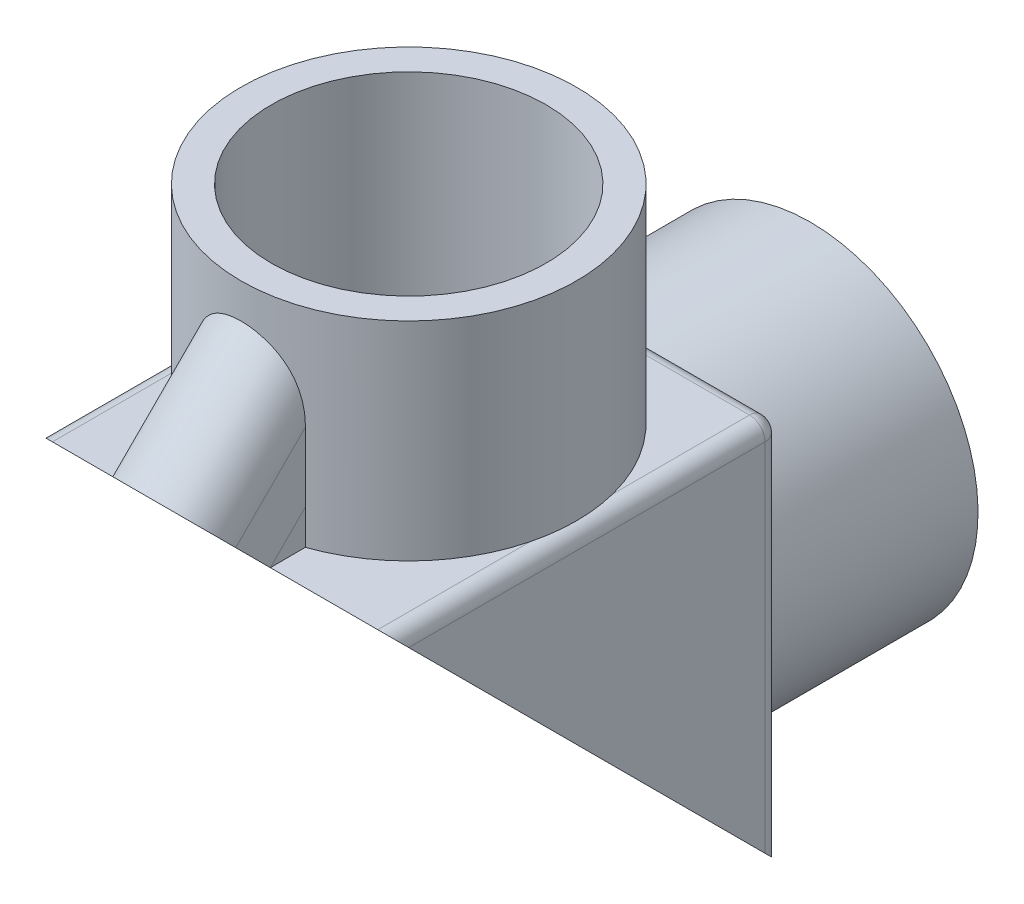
from build123d import *

# Parameters (mm, degrees)
EXTRUDE1_DEPTH                = 17.526
EXTRUDE1_DEPTH_BACK           = 17.526
FILLET1_R                     = 1.524
SHELL1_T                      = -3.81
COVERMTNGHUBS_EXTRUDE2_DEPTH  = 17.526
ODSOCKETBOSS_SKETCH2_R        = 16.51
EXTRUDE3_DEPTH                = 20.447
ODSOCKETBOSS_SKETCH4_R        = 16.51
EXTRUDE4_DEPTH                = 20.447
SKETCH6_R                     = 13.5128
SOCKET_CUT_EXTRUDE1_DEPTH     = 19.8374
SKETCH7_R                     = 13.5128
SOCKET_CUT_EXTRUDE2_DEPTH     = 19.8374
SKETCH8_R                     = 10.795
SOCKETTHRU_CUT_EXTRUDE3_DEPTH = 64.078716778
SKETCH9_R                     = 10.795
SOCKETTHRU_CUT_EXTRUDE4_DEPTH = 64.078716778


with BuildPart() as part:
    # Sketch1 → Extrude1 (new, two sides: drawn at the far end of the back side and taken through both)
    with BuildSketch(Plane(origin=(0, 0, 0), x_dir=(0, 0, -1), z_dir=(1, 0, 0)).offset(-EXTRUDE1_DEPTH_BACK)):
        Polygon((0, 19.05), (-19.05, 19.05), (19.05, -19.05), (19.05, 0), (19.05, 19.05), align=None)
    extrude(amount=EXTRUDE1_DEPTH + EXTRUDE1_DEPTH_BACK)

    # Fillet1
    fillet1_edges = [part.edges().sort_by_distance(p)[0] for p in [
        (-17.526, 0, -19.05),
        (-17.526, 19.05, 0),
        (17.526, 0, -19.05),
        (17.526, 19.05, 0),
        (0, 19.05, -19.05),
    ]]
    fillet(fillet1_edges, radius=FILLET1_R)

    # Shell1
    shell1_openings = [part.faces().sort_by_distance(p)[0] for p in [
        (0, 0, 0),
    ]]
    offset(amount=SHELL1_T, openings=shell1_openings, kind=Kind.INTERSECTION)

    # Sketch5 → CoverMtngHubs-Extrude2 (add)
    with BuildSketch(Plane(origin=(0, 0, 0), x_dir=(1, 0, 0), z_dir=(0, -0.7071067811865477, 0.7071067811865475))):
        with BuildLine():
            Line((-5.4356, 31.75), (-5.4356, 26.940768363))
            Line((-5.4356, 26.940768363), (-5.4356, 22.712927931))
            Line((-5.4356, 22.712927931), (5.41587582, 22.712927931))
            Line((5.41587582, 22.712927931), (5.4356, 26.940768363))
            Line((5.4356, 26.940768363), (5.4356, 31.75))
            ThreePointArc((5.4356, 31.75), (0, 37.1856), (-5.4356, 31.75))
        make_face()
        with BuildLine():
            Line((5.4356, -31.75), (5.4356, -26.940768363))
            Line((5.4356, -26.940768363), (5.41587582, -22.712927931))
            Line((5.41587582, -22.712927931), (-5.4356, -22.712927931))
            Line((-5.4356, -22.712927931), (-5.4356, -26.940768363))
            Line((-5.4356, -26.940768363), (-5.4356, -31.75))
            ThreePointArc((-5.4356, -31.75), (0, -37.1856), (5.4356, -31.75))
        make_face()
    extrude(amount=-COVERMTNGHUBS_EXTRUDE2_DEPTH)

    # ODsocketboss-Sketch2 → Extrude3 (add)
    with BuildSketch(Plane(origin=(0, 19.05, 0), x_dir=(-1, 0, 0), z_dir=(0, 1, 0))):
        with Locations(Location((0, 0, 0), (0, 0, 194.250032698))):
            Circle(ODSOCKETBOSS_SKETCH2_R)
    extrude(amount=EXTRUDE3_DEPTH)

    # ODsocketboss-Sketch4 → Extrude4 (add)
    with BuildSketch(Plane(origin=(0, 0, -19.05), x_dir=(-1, 0, 0), z_dir=(0, 0, -1))):
        with Locations(Location((0, 0, 0), (0, 0, 250.819808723))):
            Circle(ODSOCKETBOSS_SKETCH4_R)
    extrude(amount=EXTRUDE4_DEPTH)

    # Sketch6 → Socket--Cut-Extrude1 (cut)
    with BuildSketch(Plane(origin=(0, 0, -39.497), x_dir=(-1, 0, 0), z_dir=(0, 0, -1))):
        with Locations(Location((0, 0, 0), (0, 0, 90))):
            Circle(SKETCH6_R)
    extrude(amount=-SOCKET_CUT_EXTRUDE1_DEPTH, mode=Mode.SUBTRACT)

    # Sketch7 → Socket--Cut-Extrude2 (cut)
    with BuildSketch(Plane(origin=(0, 39.497, 0), x_dir=(-1, 0, 0), z_dir=(0, 1, 0))):
        with Locations(Location((0, 0, 0), (0, 0, 90))):
            Circle(SKETCH7_R)
    extrude(amount=-SOCKET_CUT_EXTRUDE2_DEPTH, mode=Mode.SUBTRACT)

    # Sketch8 → SocketTHRU-Cut-Extrude3 (cut, through all)
    with BuildSketch(Plane(origin=(0, 0, -19.6596), x_dir=(-1, 0, 0), z_dir=(0, 0, -1))):
        with Locations(Location((0, 0, 0), (0, 0, 90))):
            Circle(SKETCH8_R)
    extrude(amount=-SOCKETTHRU_CUT_EXTRUDE3_DEPTH, mode=Mode.SUBTRACT)

    # Sketch9 → SocketTHRU-Cut-Extrude4 (cut, through all)
    with BuildSketch(Plane(origin=(0, 19.6596, 0), x_dir=(-1, 0, 0), z_dir=(0, 1, 0))):
        with Locations(Location((0, 0, 0), (0, 0, 90))):
            Circle(SKETCH9_R)
    extrude(amount=-SOCKETTHRU_CUT_EXTRUDE4_DEPTH, mode=Mode.SUBTRACT)


solid = part.part
